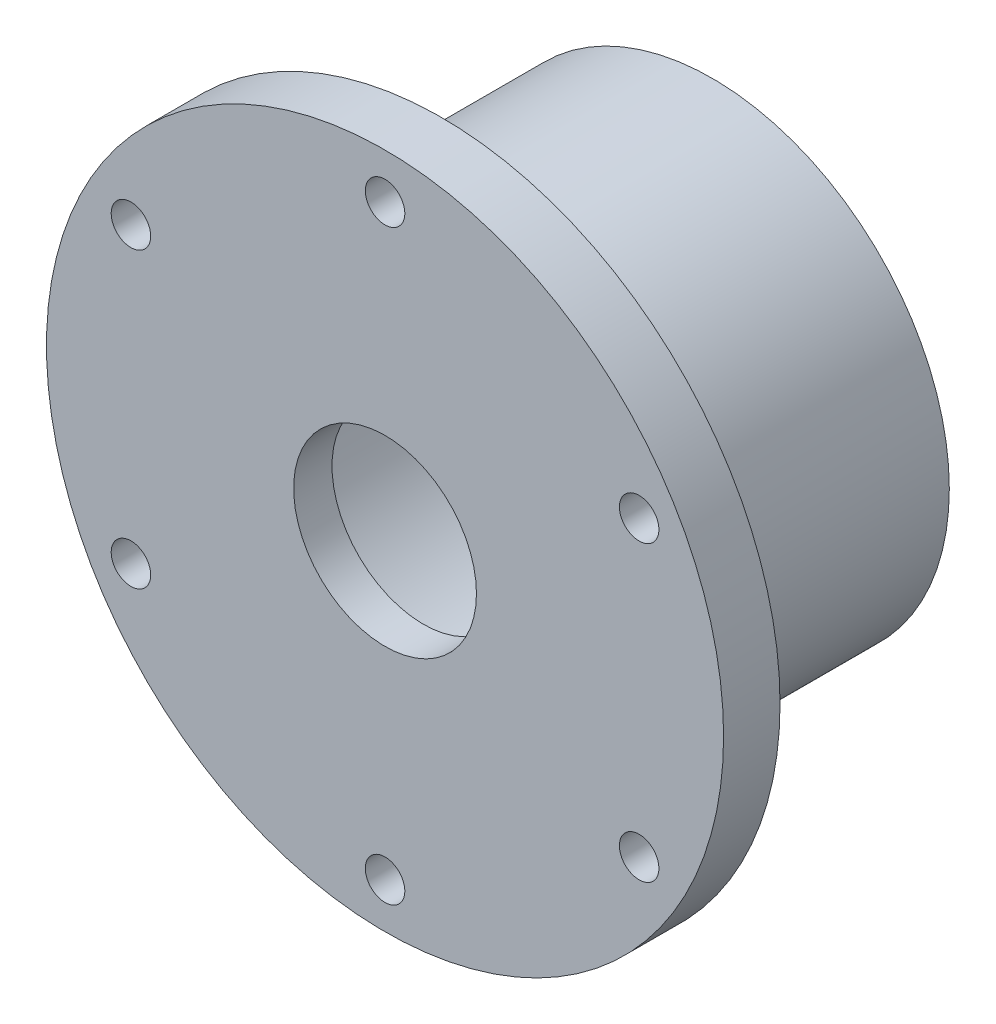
from build123d import *

# Parameters (mm, degrees)
CIRPATTERN1_COUNT = 6
CIRPATTERN2_COUNT = 6


with BuildPart() as part:
    # Sketch1 → Revolve1 (revolve)
    with BuildSketch(Plane(origin=(0, 0, 0), x_dir=(0, 0, -1), z_dir=(1, 0, 0)), mode=Mode.PRIVATE) as revolve1_sk:
        Polygon((0, 150), (0, 40.5), (17, 40.5), (17, 69.5), (22, 69.5), (22, 79.5), (145, 79.5), (145, 105), (25, 105), (25, 150), align=None)
    revolve(revolve1_sk.sketch.rotate(Axis((0, 0, 0), (0, 0, -1)), 90), axis=Axis((0, 0, 0), (0, 0, -1)))

    # Sketch3 → M8 Tapped Hole2 (revolve, cut)
    with BuildSketch(Plane(origin=(0, 90, -145), x_dir=(0, 1, 0), z_dir=(1, 0, 0))):
        Polygon((0, 0), (0, 28.042926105), (3.4, 26), (3.4, 0), align=None)
    m8_tapped_hole2 = revolve(axis=Axis((0, 90, -151.35), (0, 0, 1)), mode=Mode.SUBTRACT)

    # CirPattern1: M8 Tapped Hole2 ×6 about axis
    cirpattern1_axis = Axis((0, 0, 0), (0, 0, 1))
    for i in range(1, CIRPATTERN1_COUNT):
        add(m8_tapped_hole2.rotate(cirpattern1_axis, i * 360 / CIRPATTERN1_COUNT), mode=Mode.SUBTRACT)

    # Sketch7 → 17.5 _17.5_ Diameter Hole1 (revolve, cut)
    with BuildSketch(Plane(origin=(0, 130, -25), x_dir=(0, 1, 0), z_dir=(1, 0, 0))):
        Polygon((0, 0), (0, 31.257530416), (8.75, 26), (8.75, 0), align=None)
    f_17_5_17_5_diameter_hole1 = revolve(axis=Axis((0, 130, -31.35), (0, 0, 1)), mode=Mode.SUBTRACT)

    # CirPattern2: 17.5 _17.5_ Diameter Hole1 ×6 about axis
    cirpattern2_axis = Axis((0, 0, 0), (0, 0, 1))
    for i in range(1, CIRPATTERN2_COUNT):
        add(f_17_5_17_5_diameter_hole1.rotate(cirpattern2_axis, i * 360 / CIRPATTERN2_COUNT), mode=Mode.SUBTRACT)


solid = part.part
